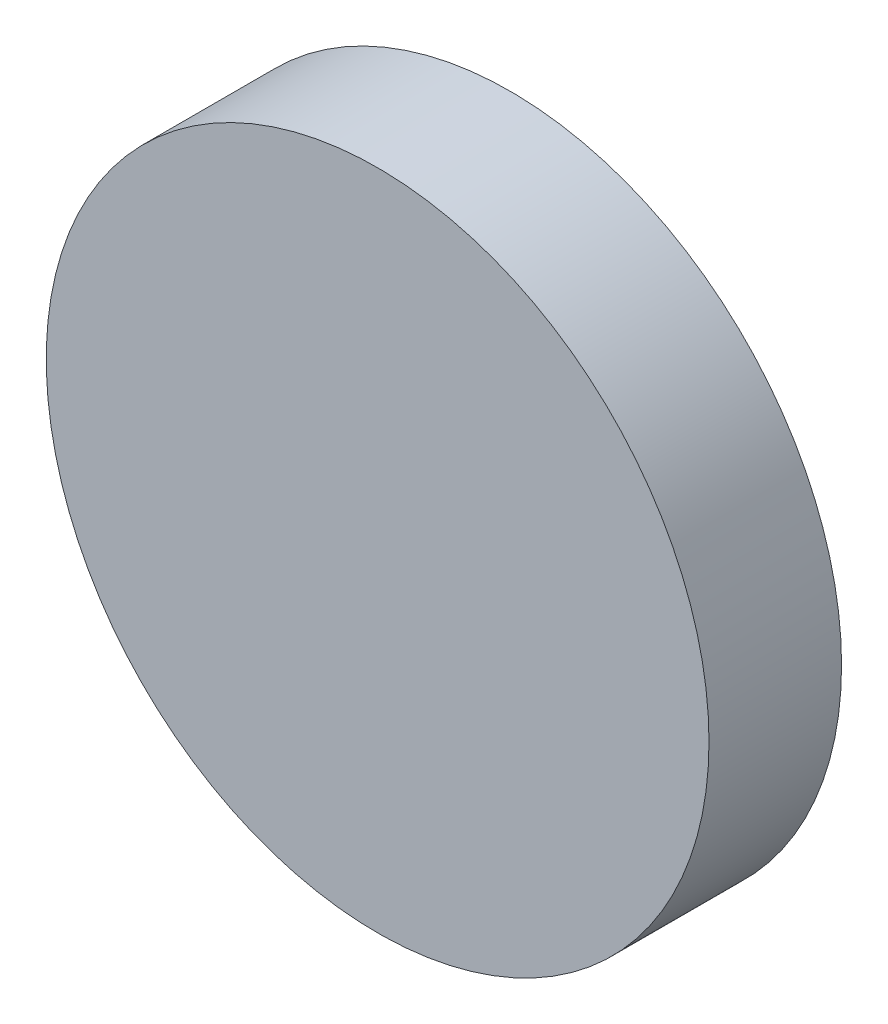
from build123d import *

# Parameters (mm, degrees)
SKETCH1_R      = 25
EXTRUDE1_DEPTH = 10


with BuildPart() as part:
    # Sketch1 → Extrude1 (new body)
    with BuildSketch(Plane.XY):
        Circle(SKETCH1_R)
    extrude(amount=EXTRUDE1_DEPTH)


solid = part.part
